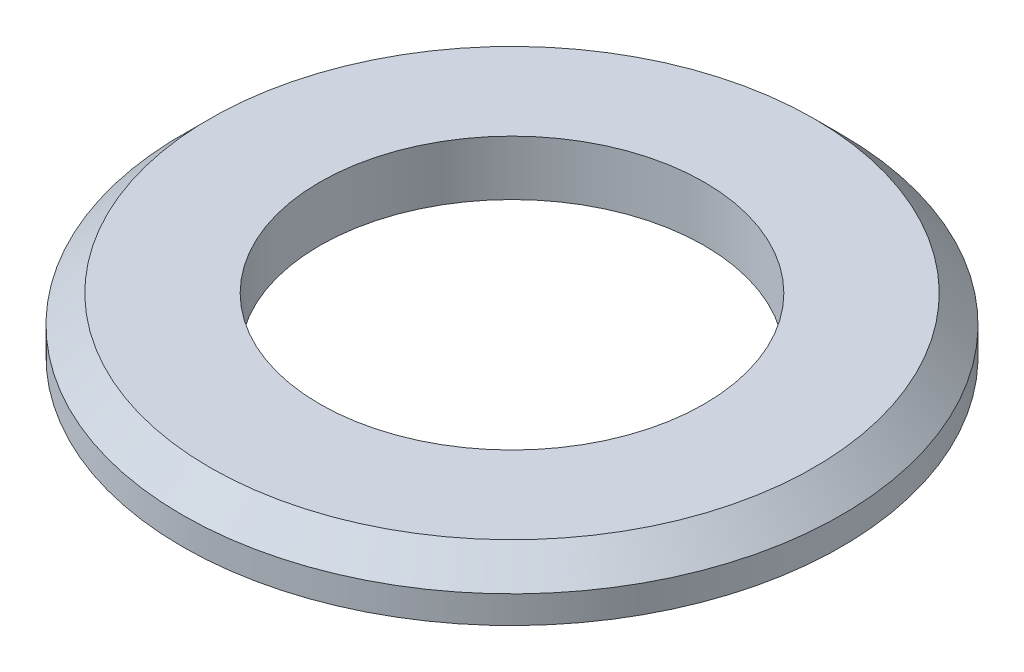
from build123d import *

# Parameters (mm, degrees)
SKETCH1_R      = 60
SKETCH1_R_2    = 35
EXTRUDE1_DEPTH = 10
CHAMFER1_SIZE  = 5


with BuildPart() as part:
    # Sketch1 → Extrude1 (new body)
    with BuildSketch(Plane(origin=(0, 0, 0), x_dir=(1, 0, 0), z_dir=(0, 1, 0))):
        with Locations(Location((0, 0, 0), (0, 0, 270))):
            Circle(SKETCH1_R)
        with Locations(Location((0, 0, 0), (0, 0, 270))):
            Circle(SKETCH1_R_2, mode=Mode.SUBTRACT)
    extrude(amount=EXTRUDE1_DEPTH)

    # Chamfer1
    chamfer1_edges = [part.edges().sort_by_distance(p)[0] for p in [
        (0, 10, -60),
    ]]
    chamfer(chamfer1_edges, length=CHAMFER1_SIZE)


solid = part.part
